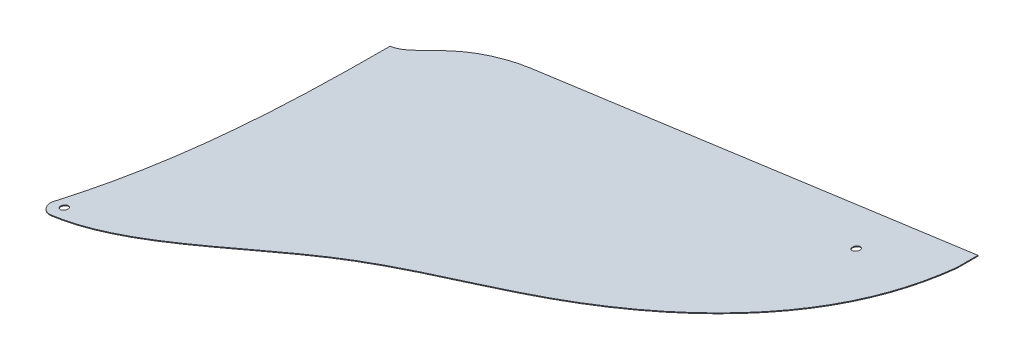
ISO-10303-21;
HEADER;
FILE_DESCRIPTION(('STEP AP214'),'2;1');
FILE_NAME('part.step','',(''),(''),'','','');
FILE_SCHEMA(('AUTOMOTIVE_DESIGN { 1 0 10303 214 1 1 1 1 }'));
ENDSEC;
DATA;
#1=APPLICATION_CONTEXT('core data for automotive mechanical design processes');
#2=APPLICATION_PROTOCOL_DEFINITION('international standard','automotive_design',2000,#1);
#3=PRODUCT_CONTEXT('',#1,'mechanical');
#4=PRODUCT('Part','Part','',(#3));
#5=PRODUCT_RELATED_PRODUCT_CATEGORY('part','',(#4));
#6=PRODUCT_DEFINITION_FORMATION('','',#4);
#7=PRODUCT_DEFINITION_CONTEXT('part definition',#1,'design');
#8=PRODUCT_DEFINITION('design','',#6,#7);
#9=PRODUCT_DEFINITION_SHAPE('','',#8);
#10=(LENGTH_UNIT() NAMED_UNIT(*) SI_UNIT(.MILLI.,.METRE.));
#11=(NAMED_UNIT(*) PLANE_ANGLE_UNIT() SI_UNIT($,.RADIAN.));
#12=(NAMED_UNIT(*) SI_UNIT($,.STERADIAN.) SOLID_ANGLE_UNIT());
#13=UNCERTAINTY_MEASURE_WITH_UNIT(LENGTH_MEASURE(1.E-05),#10,'distance_accuracy_value','');
#14=(GEOMETRIC_REPRESENTATION_CONTEXT(3) GLOBAL_UNCERTAINTY_ASSIGNED_CONTEXT((#13)) GLOBAL_UNIT_ASSIGNED_CONTEXT((#10,
#11,#12)) REPRESENTATION_CONTEXT('',''));
#15=CARTESIAN_POINT('',(0.,0.,0.));
#16=DIRECTION('',(0.,0.,1.));
#17=DIRECTION('',(1.,0.,0.));
#18=AXIS2_PLACEMENT_3D('',#15,#16,#17);
#19=CARTESIAN_POINT('',(2.243588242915,-0.1224751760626,-17.129));
#20=DIRECTION('',(0.136363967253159,-0.990658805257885,0.));
#21=DIRECTION('',(0.990658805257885,0.136363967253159,0.));
#22=AXIS2_PLACEMENT_3D('',#19,#20,#21);
#23=PLANE('',#22);
#24=CARTESIAN_POINT('',(143.620506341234,19.3380265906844,-3.3));
#25=DIRECTION('',(-0.136363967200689,0.990658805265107,0.));
#26=DIRECTION('',(-0.990658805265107,-0.136363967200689,0.));
#27=AXIS2_PLACEMENT_3D('',#24,#25,#26);
#28=CIRCLE('',#27,0.999999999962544);
#29=CARTESIAN_POINT('',(142.629847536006,19.2016626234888,-3.3));
#30=VERTEX_POINT('',#29);
#31=EDGE_CURVE('E212',#30,#30,#28,.T.);
#32=ORIENTED_EDGE('',*,*,#31,.T.);
#33=EDGE_LOOP('',(#32));
#34=FACE_BOUND('',#33,.T.);
#35=CARTESIAN_POINT('',(8.89090882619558,0.792527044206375,75.2));
#36=DIRECTION('',(-0.136363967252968,0.990658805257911,0.));
#37=DIRECTION('',(-0.990658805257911,-0.136363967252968,0.));
#38=AXIS2_PLACEMENT_3D('',#35,#36,#37);
#39=CIRCLE('',#38,0.999999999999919);
#40=CARTESIAN_POINT('',(7.90025002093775,0.656163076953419,75.2));
#41=VERTEX_POINT('',#40);
#42=EDGE_CURVE('E87',#41,#41,#39,.T.);
#43=ORIENTED_EDGE('',*,*,#42,.T.);
#44=EDGE_LOOP('',(#43));
#45=FACE_BOUND('',#44,.T.);
#46=CARTESIAN_POINT('',(5.42360300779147,0.315253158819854,75.2));
#47=CARTESIAN_POINT('',(5.82346646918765,0.370294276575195,74.0910827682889));
#48=CARTESIAN_POINT('',(6.20973839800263,0.423464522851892,72.9771907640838));
#49=CARTESIAN_POINT('',(6.95545757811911,0.526112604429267,70.740491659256));
#50=CARTESIAN_POINT('',(7.31490914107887,0.575591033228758,69.6176860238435));
#51=CARTESIAN_POINT('',(8.00745829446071,0.670920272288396,67.3638891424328));
#52=CARTESIAN_POINT('',(8.34055712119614,0.716771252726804,66.2328982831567));
#53=CARTESIAN_POINT('',(8.98020497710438,0.804818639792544,63.9662637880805));
#54=CARTESIAN_POINT('',(9.2868164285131,0.847023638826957,62.8306380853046));
#55=CARTESIAN_POINT('',(9.87505405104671,0.927994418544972,60.5527722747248));
#56=CARTESIAN_POINT('',(10.1566793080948,0.966760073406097,59.4105319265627));
#57=CARTESIAN_POINT('',(10.6956799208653,1.04095338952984,57.1202449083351));
#58=CARTESIAN_POINT('',(10.9530551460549,1.07638103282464,55.9721982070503));
#59=CARTESIAN_POINT('',(11.5669687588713,1.16088610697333,53.0968555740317));
#60=CARTESIAN_POINT('',(11.9089059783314,1.20795369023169,51.366367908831));
#61=CARTESIAN_POINT('',(12.543218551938,1.29526667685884,47.8962246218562));
#62=CARTESIAN_POINT('',(12.8355940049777,1.33551209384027,46.1565690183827));
#63=CARTESIAN_POINT('',(13.3745429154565,1.40969829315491,42.6675794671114));
#64=CARTESIAN_POINT('',(13.6210518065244,1.44363018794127,40.9182353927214));
#65=CARTESIAN_POINT('',(14.0713490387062,1.50561350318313,37.4140290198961));
#66=CARTESIAN_POINT('',(14.2751382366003,1.53366504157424,35.6591668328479));
#67=CARTESIAN_POINT('',(14.6873267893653,1.59040270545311,31.7297281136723));
#68=CARTESIAN_POINT('',(14.8854160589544,1.61766964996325,29.5540514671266));
#69=CARTESIAN_POINT('',(15.2292268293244,1.66499512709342,25.1982499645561));
#70=CARTESIAN_POINT('',(15.3749408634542,1.68505263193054,23.0181245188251));
#71=CARTESIAN_POINT('',(15.6212704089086,1.71895983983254,18.6548571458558));
#72=CARTESIAN_POINT('',(15.7218762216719,1.73280820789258,16.4717146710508));
#73=CARTESIAN_POINT('',(15.8848989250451,1.75524824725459,12.1117091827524));
#74=CARTESIAN_POINT('',(15.947448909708,1.76385823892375,9.93485109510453));
#75=CARTESIAN_POINT('',(16.0419842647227,1.77687100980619,5.5810160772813));
#76=CARTESIAN_POINT('',(16.0739768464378,1.78127478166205,3.40403929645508));
#77=CARTESIAN_POINT('',(16.1143234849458,1.78682848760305,-0.948651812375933));
#78=CARTESIAN_POINT('',(16.1226937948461,1.78798065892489,-3.124365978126));
#79=CARTESIAN_POINT('',(16.1227181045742,1.78798400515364,-5.30000000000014));
#80=B_SPLINE_CURVE_WITH_KNOTS('',3,(#46,#47,#48,#49,#50,#51,#52,#53,#54,#55,#56,#57,#58,#59,#60,
#61,#62,#63,#64,#65,#66,#67,#68,#69,#70,#71,#72,#73,#74,#75,#76,#77,#78,#79),.UNSPECIFIED.,.F.,
.F.,(4,2,2,2,2,2,2,2,2,2,2,2,2,2,2,2,4),(0.,3.54016044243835,7.07975053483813,10.6191744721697,
14.150015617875,17.6809858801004,21.2119751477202,26.5048585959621,31.7977314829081,
37.0979996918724,42.3981615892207,48.9519272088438,55.5066267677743,62.0627349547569,
68.5957804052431,75.1272837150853,81.654291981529),.UNSPECIFIED.);
#81=CARTESIAN_POINT('',(5.42360300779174,0.315253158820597,75.2000000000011));
#82=VERTEX_POINT('',#81);
#83=CARTESIAN_POINT('',(16.1227181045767,1.78798400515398,-5.30000000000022));
#84=VERTEX_POINT('',#83);
#85=EDGE_CURVE('E149',#82,#84,#80,.T.);
#86=ORIENTED_EDGE('',*,*,#85,.T.);
#87=CARTESIAN_POINT('',(16.1227181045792,1.78798400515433,-5.30000000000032));
#88=CARTESIAN_POINT('',(16.2384534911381,1.80391495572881,-5.29999489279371));
#89=CARTESIAN_POINT('',(16.3542037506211,1.81984795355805,-5.30221710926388));
#90=CARTESIAN_POINT('',(16.5855512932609,1.85169289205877,-5.31144087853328));
#91=CARTESIAN_POINT('',(16.7011485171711,1.86760482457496,-5.31844392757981));
#92=CARTESIAN_POINT('',(16.9319672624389,1.89937697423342,-5.3375571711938));
#93=CARTESIAN_POINT('',(17.0471886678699,1.91523717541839,-5.34966881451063));
#94=CARTESIAN_POINT('',(17.2769442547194,1.94686298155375,-5.37925722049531));
#95=CARTESIAN_POINT('',(17.3914785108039,1.96262859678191,-5.39673338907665));
#96=CARTESIAN_POINT('',(17.6154618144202,1.99345984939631,-5.43649128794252));
#97=CARTESIAN_POINT('',(17.7249450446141,2.0085301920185,-5.45857651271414));
#98=CARTESIAN_POINT('',(17.9427681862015,2.03851349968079,-5.50794164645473));
#99=CARTESIAN_POINT('',(18.0511079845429,2.05342644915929,-5.5352220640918));
#100=CARTESIAN_POINT('',(18.2662812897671,2.08304500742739,-5.59487013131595));
#101=CARTESIAN_POINT('',(18.3731162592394,2.09775081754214,-5.62723240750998));
#102=CARTESIAN_POINT('',(18.5851970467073,2.12694369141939,-5.69685033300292));
#103=CARTESIAN_POINT('',(18.6904429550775,2.14143076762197,-5.73410570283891));
#104=CARTESIAN_POINT('',(18.9455592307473,2.17654746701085,-5.83072824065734));
#105=CARTESIAN_POINT('',(19.0945117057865,2.19705074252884,-5.89257240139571));
#106=CARTESIAN_POINT('',(19.3888474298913,2.23756599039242,-6.02437710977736));
#107=CARTESIAN_POINT('',(19.5342299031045,2.2575778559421,-6.09433940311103));
#108=CARTESIAN_POINT('',(19.8222650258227,2.29722582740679,-6.24088535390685));
#109=CARTESIAN_POINT('',(19.964906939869,2.31686045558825,-6.31749033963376));
#110=CARTESIAN_POINT('',(20.1769668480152,2.34605045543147,-6.43582836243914));
#111=CARTESIAN_POINT('',(20.2473367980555,2.35573686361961,-6.4758464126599));
#112=CARTESIAN_POINT('',(20.3875654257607,2.37503930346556,-6.55678612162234));
#113=CARTESIAN_POINT('',(20.4574241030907,2.38465533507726,-6.59770778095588));
#114=CARTESIAN_POINT('',(20.666508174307,2.4134357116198,-6.72179542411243));
#115=CARTESIAN_POINT('',(20.8050325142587,2.43250355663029,-6.80616636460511));
#116=CARTESIAN_POINT('',(21.0804353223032,2.4704126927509,-6.97757923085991));
#117=CARTESIAN_POINT('',(21.2173138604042,2.48925399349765,-7.06462104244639));
#118=CARTESIAN_POINT('',(21.4930656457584,2.52721116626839,-7.24306588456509));
#119=CARTESIAN_POINT('',(21.6319041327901,2.54632225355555,-7.33452353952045));
#120=CARTESIAN_POINT('',(21.9083976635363,2.58438152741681,-7.51924418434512));
#121=CARTESIAN_POINT('',(22.0460526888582,2.60332971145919,-7.61250720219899));
#122=CARTESIAN_POINT('',(22.4570339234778,2.65990118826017,-7.89391551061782));
#123=CARTESIAN_POINT('',(22.7289955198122,2.69733664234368,-8.08408639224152));
#124=CARTESIAN_POINT('',(23.2713572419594,2.7719926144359,-8.46670249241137));
#125=CARTESIAN_POINT('',(23.5417572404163,2.8092131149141,-8.65914789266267));
#126=CARTESIAN_POINT('',(24.1350997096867,2.89088657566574,-9.08048310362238));
#127=CARTESIAN_POINT('',(24.4581289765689,2.935351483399,-9.3092515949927));
#128=CARTESIAN_POINT('',(24.9456330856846,3.00245631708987,-9.64832852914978));
#129=CARTESIAN_POINT('',(25.1086849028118,3.02490036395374,-9.76071315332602));
#130=CARTESIAN_POINT('',(25.4361256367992,3.06997250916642,-9.98348496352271));
#131=CARTESIAN_POINT('',(25.6005145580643,3.09260060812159,-10.0938721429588));
#132=CARTESIAN_POINT('',(25.9309020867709,3.13807837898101,-10.3119389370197));
#133=CARTESIAN_POINT('',(26.0968995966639,3.16092789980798,-10.4196202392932));
#134=CARTESIAN_POINT('',(26.3474420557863,3.19541501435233,-10.5786572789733));
#135=CARTESIAN_POINT('',(26.4312136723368,3.20694615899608,-10.6312553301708));
#136=CARTESIAN_POINT('',(26.5993205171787,3.2300860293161,-10.7355253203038));
#137=CARTESIAN_POINT('',(26.6836557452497,3.24169475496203,-10.7871972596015));
#138=CARTESIAN_POINT('',(26.9373812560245,3.27662001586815,-10.9407133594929));
#139=CARTESIAN_POINT('',(27.1076177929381,3.30005303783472,-11.0411382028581));
#140=CARTESIAN_POINT('',(27.4502437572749,3.34721542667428,-11.23817038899));
#141=CARTESIAN_POINT('',(27.622633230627,3.37094479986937,-11.334777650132));
#142=CARTESIAN_POINT('',(28.1428088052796,3.44254685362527,-11.6187773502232));
#143=CARTESIAN_POINT('',(28.4937043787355,3.49084755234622,-11.8004095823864));
#144=CARTESIAN_POINT('',(29.1982475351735,3.58782776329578,-12.1459087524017));
#145=CARTESIAN_POINT('',(29.55179798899,3.63649390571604,-12.309978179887));
#146=CARTESIAN_POINT('',(30.2658303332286,3.734780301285,-12.6233889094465));
#147=CARTESIAN_POINT('',(30.626321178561,3.78440178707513,-12.7727094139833));
#148=CARTESIAN_POINT('',(31.3533166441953,3.88447255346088,-13.0567934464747));
#149=CARTESIAN_POINT('',(31.7198272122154,3.93492265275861,-13.1915414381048));
#150=CARTESIAN_POINT('',(32.4578923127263,4.03651715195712,-13.4468101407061));
#151=CARTESIAN_POINT('',(32.8294494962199,4.08766191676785,-13.5673230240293));
#152=CARTESIAN_POINT('',(33.576575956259,4.1905037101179,-13.7946414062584));
#153=CARTESIAN_POINT('',(33.9521444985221,4.24220063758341,-13.9014493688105));
#154=CARTESIAN_POINT('',(34.6486450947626,4.33807379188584,-14.0865175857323));
#155=CARTESIAN_POINT('',(34.9690935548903,4.38218345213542,-14.1666417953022));
#156=CARTESIAN_POINT('',(35.6118366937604,4.47065690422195,-14.3177377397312));
#157=CARTESIAN_POINT('',(35.9341297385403,4.51502047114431,-14.3887165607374));
#158=CARTESIAN_POINT('',(36.5803395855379,4.60397111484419,-14.5218277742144));
#159=CARTESIAN_POINT('',(36.904255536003,4.64855807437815,-14.583964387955));
#160=CARTESIAN_POINT('',(37.5535022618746,4.73792674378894,-14.6996450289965));
#161=CARTESIAN_POINT('',(37.8788326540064,4.78270840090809,-14.7531912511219));
#162=CARTESIAN_POINT('',(38.5307074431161,4.87243882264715,-14.8518960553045));
#163=CARTESIAN_POINT('',(38.8572517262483,4.91738757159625,-14.8970554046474));
#164=CARTESIAN_POINT('',(39.5162320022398,5.00809606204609,-14.9797564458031));
#165=CARTESIAN_POINT('',(39.848683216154,5.05385789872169,-15.0171744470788));
#166=CARTESIAN_POINT('',(40.5144555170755,5.14550130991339,-15.0836546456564));
#167=CARTESIAN_POINT('',(40.8477767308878,5.19138290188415,-15.1127155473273));
#168=CARTESIAN_POINT('',(41.5150969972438,5.28323939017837,-15.1625496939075));
#169=CARTESIAN_POINT('',(41.8490961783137,5.32921430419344,-15.1833211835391));
#170=CARTESIAN_POINT('',(42.5175834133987,5.42123142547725,-15.2165989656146));
#171=CARTESIAN_POINT('',(42.8520715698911,5.46727364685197,-15.2291031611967));
#172=CARTESIAN_POINT('',(43.5213505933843,5.55939975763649,-15.2457999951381));
#173=CARTESIAN_POINT('',(43.85614152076,5.60548365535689,-15.2499901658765));
#174=CARTESIAN_POINT('',(44.1909336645,5.65156772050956,-15.2500006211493));
#175=B_SPLINE_CURVE_WITH_KNOTS('',3,(#87,#88,#89,#90,#91,#92,#93,#94,#95,#96,#97,#98,#99,#100,
#101,#102,#103,#104,#105,#106,#107,#108,#109,#110,#111,#112,#113,#114,#115,#116,#117,#118,#119,
#120,#121,#122,#123,#124,#125,#126,#127,#128,#129,#130,#131,#132,#133,#134,#135,#136,#137,#138,
#139,#140,#141,#142,#143,#144,#145,#146,#147,#148,#149,#150,#151,#152,#153,#154,#155,#156,#157,
#158,#159,#160,#161,#162,#163,#164,#165,#166,#167,#168,#169,#170,#171,#172,#173,#174),
.UNSPECIFIED.,.F.,.F.,(4,2,2,2,2,2,2,2,2,2,2,2,2,2,2,2,2,2,2,2,2,2,2,2,2,2,2,2,2,2,2,2,2,2,2,2,
2,2,2,2,2,2,2,4),(0.,0.35048112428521,0.701071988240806,1.05176234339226,1.40241387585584,
1.74039246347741,2.07840416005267,2.41606083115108,2.75369822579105,3.24113172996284,
3.7286702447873,4.21783661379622,4.46242314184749,4.70700983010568,5.19690802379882,
5.6867853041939,6.18881595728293,6.69085439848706,7.69269517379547,8.69461653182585,
9.88955570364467,10.4874402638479,11.0853267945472,11.6828306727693,11.9815809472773,
12.2803311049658,12.8773790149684,13.4744396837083,14.6682001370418,15.8462365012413,
17.0259109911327,18.2068310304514,19.3883974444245,20.5697511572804,21.56935792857,
22.5681854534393,23.5665345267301,24.5646281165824,25.5626303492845,26.5755208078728,
27.5885682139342,28.601830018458,29.6153487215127,30.6291681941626),.UNSPECIFIED.);
#176=CARTESIAN_POINT('',(44.1909336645,5.65156772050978,-15.2500003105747));
#177=VERTEX_POINT('',#176);
#178=EDGE_CURVE('E148',#84,#177,#175,.T.);
#179=ORIENTED_EDGE('',*,*,#178,.T.);
#180=DIRECTION('',(0.990658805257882,0.136363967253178,0.));
#181=VECTOR('',#180,1.);
#182=CARTESIAN_POINT('',(104.307639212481,13.9266190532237,-15.25));
#183=LINE('',#182,#181);
#184=CARTESIAN_POINT('',(164.424341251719,22.2016699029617,-15.25));
#185=VERTEX_POINT('',#184);
#186=EDGE_CURVE('E90',#177,#185,#183,.T.);
#187=ORIENTED_EDGE('',*,*,#186,.T.);
#188=DIRECTION('',(0.,0.,1.));
#189=VECTOR('',#188,1.);
#190=CARTESIAN_POINT('',(164.424341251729,22.201669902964,-12.4249999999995));
#191=LINE('',#190,#189);
#192=CARTESIAN_POINT('',(164.424341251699,22.201669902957,-9.60000000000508));
#193=VERTEX_POINT('',#192);
#194=EDGE_CURVE('E85',#185,#193,#191,.T.);
#195=ORIENTED_EDGE('',*,*,#194,.T.);
#196=CARTESIAN_POINT('',(164.424341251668,22.2016699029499,-9.60000000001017));
#197=CARTESIAN_POINT('',(164.34025832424,22.1900959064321,-8.99661350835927));
#198=CARTESIAN_POINT('',(164.247165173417,22.1772816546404,-8.39448718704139));
#199=CARTESIAN_POINT('',(164.042453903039,22.1491031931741,-7.19308197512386));
#200=CARTESIAN_POINT('',(163.930824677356,22.1337374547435,-6.59380501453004));
#201=CARTESIAN_POINT('',(163.688598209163,22.1003950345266,-5.39896265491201));
#202=CARTESIAN_POINT('',(163.557994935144,22.0824175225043,-4.80339849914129));
#203=CARTESIAN_POINT('',(163.277476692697,22.0438042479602,-3.61683978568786));
#204=CARTESIAN_POINT('',(163.127559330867,22.0231681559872,-3.02584580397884));
#205=CARTESIAN_POINT('',(162.808154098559,21.9792020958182,-1.84926239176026));
#206=CARTESIAN_POINT('',(162.638666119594,21.955872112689,-1.26367299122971));
#207=CARTESIAN_POINT('',(162.281744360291,21.9067419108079,-0.104513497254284));
#208=CARTESIAN_POINT('',(162.094507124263,21.8809687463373,0.46911823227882));
#209=CARTESIAN_POINT('',(161.700651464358,21.8267546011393,1.60946740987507));
#210=CARTESIAN_POINT('',(161.494035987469,21.7983140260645,2.17618589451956));
#211=CARTESIAN_POINT('',(161.061476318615,21.7387722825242,3.30196512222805));
#212=CARTESIAN_POINT('',(160.83553487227,21.7076714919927,3.86102694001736));
#213=CARTESIAN_POINT('',(160.364476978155,21.6428304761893,4.97079461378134));
#214=CARTESIAN_POINT('',(160.119362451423,21.609090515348,5.52150130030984));
#215=CARTESIAN_POINT('',(159.610223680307,21.5390076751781,6.61389422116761));
#216=CARTESIAN_POINT('',(159.346200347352,21.5026649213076,7.15558088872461));
#217=CARTESIAN_POINT('',(158.730033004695,21.4178496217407,8.36598934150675));
#218=CARTESIAN_POINT('',(158.372563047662,21.3686439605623,9.03195668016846));
#219=CARTESIAN_POINT('',(157.629336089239,21.2663389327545,10.3477047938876));
#220=CARTESIAN_POINT('',(157.243575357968,21.2132390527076,10.9974834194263));
#221=CARTESIAN_POINT('',(156.444952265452,21.1033087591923,12.2799041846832));
#222=CARTESIAN_POINT('',(156.032087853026,21.0464780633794,12.9125450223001));
#223=CARTESIAN_POINT('',(155.180659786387,20.9292791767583,14.159855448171));
#224=CARTESIAN_POINT('',(154.742098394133,20.8689112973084,14.7745266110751));
#225=CARTESIAN_POINT('',(153.839380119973,20.7446523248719,15.9873693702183));
#226=CARTESIAN_POINT('',(153.375148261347,20.6807509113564,16.585484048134));
#227=CARTESIAN_POINT('',(152.424046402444,20.5498319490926,17.763011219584));
#228=CARTESIAN_POINT('',(151.93717753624,20.4828145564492,18.3424246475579));
#229=CARTESIAN_POINT('',(150.942355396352,20.3458775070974,19.4825780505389));
#230=CARTESIAN_POINT('',(150.434400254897,20.2759575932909,20.0433163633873));
#231=CARTESIAN_POINT('',(149.398992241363,20.1334339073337,21.1461643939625));
#232=CARTESIAN_POINT('',(148.871538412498,20.0608300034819,21.6882731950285));
#233=CARTESIAN_POINT('',(147.696651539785,19.8991070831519,22.8553245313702));
#234=CARTESIAN_POINT('',(147.045470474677,19.8094721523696,23.4764247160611));
#235=CARTESIAN_POINT('',(145.719871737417,19.627003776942,24.6930073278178));
#236=CARTESIAN_POINT('',(145.045450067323,19.5341697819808,25.288485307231));
#237=CARTESIAN_POINT('',(143.675424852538,19.3455861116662,26.4544693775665));
#238=CARTESIAN_POINT('',(142.979815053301,19.249835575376,27.0249679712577));
#239=CARTESIAN_POINT('',(141.56943775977,19.0556974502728,28.1415758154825));
#240=CARTESIAN_POINT('',(140.854666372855,18.9573093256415,28.6876800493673));
#241=CARTESIAN_POINT('',(139.407952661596,18.7581695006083,29.7560413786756));
#242=CARTESIAN_POINT('',(138.676011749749,18.657417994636,30.2783004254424));
#243=CARTESIAN_POINT('',(137.197117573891,18.453848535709,31.2993386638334));
#244=CARTESIAN_POINT('',(136.450176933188,18.3510323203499,31.7981365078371));
#245=CARTESIAN_POINT('',(134.94236127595,18.1434818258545,32.7733069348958));
#246=CARTESIAN_POINT('',(134.181490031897,18.0387480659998,33.2496854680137));
#247=CARTESIAN_POINT('',(132.646974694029,17.8275223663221,34.1808464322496));
#248=CARTESIAN_POINT('',(131.87333151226,17.721030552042,34.6356303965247));
#249=CARTESIAN_POINT('',(130.314376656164,17.5064407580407,35.5243382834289));
#250=CARTESIAN_POINT('',(129.529064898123,17.3983427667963,35.9582620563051));
#251=CARTESIAN_POINT('',(127.947838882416,17.1806873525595,36.8058970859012));
#252=CARTESIAN_POINT('',(127.151924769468,17.0711299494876,37.2196086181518));
#253=CARTESIAN_POINT('',(125.247695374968,16.8090131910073,38.1801507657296));
#254=CARTESIAN_POINT('',(124.135017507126,16.6558533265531,38.718186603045));
#255=CARTESIAN_POINT('',(121.893227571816,16.3472714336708,39.7586548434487));
#256=CARTESIAN_POINT('',(120.764112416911,16.1918489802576,40.2610804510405));
#257=CARTESIAN_POINT('',(118.491173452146,15.878979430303,41.23164528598));
#258=CARTESIAN_POINT('',(117.347345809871,15.7215318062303,41.69977535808));
#259=CARTESIAN_POINT('',(115.046634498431,15.4048393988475,42.6028266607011));
#260=CARTESIAN_POINT('',(113.889748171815,15.2455942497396,43.0377409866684));
#261=CARTESIAN_POINT('',(111.564477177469,14.9255212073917,43.875053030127));
#262=CARTESIAN_POINT('',(110.396092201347,14.7646932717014,44.2774498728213));
#263=CARTESIAN_POINT('',(108.050722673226,14.4418536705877,45.0539616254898));
#264=CARTESIAN_POINT('',(106.873741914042,14.2798425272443,45.4280882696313));
#265=CARTESIAN_POINT('',(104.510319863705,13.9545180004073,46.1540185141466));
#266=CARTESIAN_POINT('',(103.323863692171,13.7912025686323,46.5057724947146));
#267=CARTESIAN_POINT('',(100.946401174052,13.4639453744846,47.1912749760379));
#268=CARTESIAN_POINT('',(99.755396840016,13.3000038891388,47.5250306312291));
#269=CARTESIAN_POINT('',(97.3701130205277,12.9716700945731,48.1802819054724));
#270=CARTESIAN_POINT('',(96.1758335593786,12.8072777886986,48.5017776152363));
#271=CARTESIAN_POINT('',(93.785304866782,12.4782220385,49.1383717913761));
#272=CARTESIAN_POINT('',(92.5890552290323,12.3135585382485,49.4534686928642));
#273=CARTESIAN_POINT('',(90.1959198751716,11.9841439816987,50.0832358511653));
#274=CARTESIAN_POINT('',(88.9990341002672,11.8193929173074,50.3979058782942));
#275=CARTESIAN_POINT('',(86.6059823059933,11.4899898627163,51.0328814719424));
#276=CARTESIAN_POINT('',(85.4098170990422,11.3253379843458,51.3531901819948));
#277=CARTESIAN_POINT('',(83.1381854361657,11.0126483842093,51.973206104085));
#278=CARTESIAN_POINT('',(82.0624319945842,10.8645711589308,52.271836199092));
#279=CARTESIAN_POINT('',(79.9146377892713,10.5689277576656,52.8828862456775));
#280=CARTESIAN_POINT('',(78.8425974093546,10.4213616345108,53.1953075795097));
#281=CARTESIAN_POINT('',(76.7042637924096,10.1270204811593,53.8381179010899));
#282=CARTESIAN_POINT('',(75.6379684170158,9.98024515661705,54.168499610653));
#283=CARTESIAN_POINT('',(73.5131043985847,9.68775809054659,54.8513133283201));
#284=CARTESIAN_POINT('',(72.4545308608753,9.54204567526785,55.2037297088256));
#285=CARTESIAN_POINT('',(70.8737658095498,9.32445371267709,55.7518776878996));
#286=CARTESIAN_POINT('',(70.3482188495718,9.25211228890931,55.9377755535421));
#287=CARTESIAN_POINT('',(69.2996064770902,9.10777102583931,56.31658333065));
#288=CARTESIAN_POINT('',(68.7765410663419,9.0357711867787,56.5094932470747));
#289=CARTESIAN_POINT('',(67.7334431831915,8.8921889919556,56.9026728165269));
#290=CARTESIAN_POINT('',(67.2134092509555,8.82060643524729,57.1029385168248));
#291=CARTESIAN_POINT('',(66.4356419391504,8.7135469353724,57.4092321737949));
#292=CARTESIAN_POINT('',(66.1767667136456,8.67791281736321,57.5123125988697));
#293=CARTESIAN_POINT('',(65.6598193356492,8.60675512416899,57.7205052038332));
#294=CARTESIAN_POINT('',(65.401747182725,8.57123154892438,57.8256173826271));
#295=CARTESIAN_POINT('',(64.6264665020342,8.46451433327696,58.1448681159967));
#296=CARTESIAN_POINT('',(64.1104744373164,8.39348813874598,58.3620225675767));
#297=CARTESIAN_POINT('',(63.0814894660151,8.25184858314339,58.8034509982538));
#298=CARTESIAN_POINT('',(62.5684965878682,8.18123522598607,59.0277250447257));
#299=CARTESIAN_POINT('',(61.5449860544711,8.04034922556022,59.482696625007));
#300=CARTESIAN_POINT('',(61.0344698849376,7.97007678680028,59.7133975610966));
#301=CARTESIAN_POINT('',(60.0159186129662,7.82987342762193,60.1803008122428));
#302=CARTESIAN_POINT('',(59.5078835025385,7.75994250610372,60.4165031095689));
#303=CARTESIAN_POINT('',(57.9862959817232,7.55049631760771,61.1325520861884));
#304=CARTESIAN_POINT('',(56.9760233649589,7.41143251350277,61.6194994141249));
#305=CARTESIAN_POINT('',(54.9610995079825,7.13407868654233,62.6066506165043));
#306=CARTESIAN_POINT('',(53.9564522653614,6.99578921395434,63.106862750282));
#307=CARTESIAN_POINT('',(51.9504542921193,6.71966403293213,64.1147129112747));
#308=CARTESIAN_POINT('',(50.9491046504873,6.58182847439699,64.6223531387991));
#309=CARTESIAN_POINT('',(48.9474299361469,6.30629838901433,65.6392997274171));
#310=CARTESIAN_POINT('',(47.9471047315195,6.16860384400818,66.1486058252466));
#311=CARTESIAN_POINT('',(46.0693808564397,5.91013556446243,67.1002279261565));
#312=CARTESIAN_POINT('',(45.1922006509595,5.78939190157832,67.5429815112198));
#313=CARTESIAN_POINT('',(43.4349792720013,5.54751076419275,68.4217019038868));
#314=CARTESIAN_POINT('',(42.5549395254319,5.42637348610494,68.8576716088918));
#315=CARTESIAN_POINT('',(40.7900601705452,5.18343823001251,69.7191013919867));
#316=CARTESIAN_POINT('',(39.9052217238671,5.06164041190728,70.1445638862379));
#317=CARTESIAN_POINT('',(38.1287602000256,4.81711087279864,70.9811597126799));
#318=CARTESIAN_POINT('',(37.2371362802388,4.69437903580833,71.3922912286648));
#319=CARTESIAN_POINT('',(35.44505126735,4.44769892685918,72.1962658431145));
#320=CARTESIAN_POINT('',(34.5445844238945,4.32374986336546,72.5890959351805));
#321=CARTESIAN_POINT('',(32.7450904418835,4.07604991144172,73.3470902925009));
#322=CARTESIAN_POINT('',(31.8461788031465,3.95231492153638,73.7125327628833));
#323=CARTESIAN_POINT('',(30.0377315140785,3.70338254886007,74.4165233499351));
#324=CARTESIAN_POINT('',(29.1281928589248,3.57818475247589,74.7550636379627));
#325=CARTESIAN_POINT('',(27.2985206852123,3.32633077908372,75.4002162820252));
#326=CARTESIAN_POINT('',(26.3783926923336,3.19967536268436,75.7068445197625));
#327=CARTESIAN_POINT('',(24.5276152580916,2.94491625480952,76.2832141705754));
#328=CARTESIAN_POINT('',(23.5969747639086,2.81681379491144,76.5529847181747));
#329=CARTESIAN_POINT('',(21.7252351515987,2.55916924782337,77.0508242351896));
#330=CARTESIAN_POINT('',(20.7841418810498,2.42962796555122,77.27891538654));
#331=CARTESIAN_POINT('',(19.24323471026,2.21752243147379,77.6126532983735));
#332=CARTESIAN_POINT('',(18.6463810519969,2.13536565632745,77.7323267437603));
#333=CARTESIAN_POINT('',(17.4491488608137,1.97056690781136,77.9521919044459));
#334=CARTESIAN_POINT('',(16.8487703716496,1.88792494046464,78.0523838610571));
#335=CARTESIAN_POINT('',(15.6450565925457,1.72223400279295,78.2322067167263));
#336=CARTESIAN_POINT('',(15.0417216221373,1.6391850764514,78.3118397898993));
#337=CARTESIAN_POINT('',(13.8236622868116,1.47151947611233,78.4506259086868));
#338=CARTESIAN_POINT('',(13.2089017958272,1.38689782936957,78.5094574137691));
#339=CARTESIAN_POINT('',(11.9775427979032,1.21740153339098,78.6041087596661));
#340=CARTESIAN_POINT('',(11.3609440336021,1.13252684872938,78.6399252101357));
#341=CARTESIAN_POINT('',(10.1265417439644,0.962611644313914,78.6878940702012));
#342=CARTESIAN_POINT('',(9.50873777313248,0.8775710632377,78.7000347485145));
#343=CARTESIAN_POINT('',(8.89090882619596,0.79252704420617,78.7000000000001));
#344=B_SPLINE_CURVE_WITH_KNOTS('',3,(#196,#197,#198,#199,#200,#201,#202,#203,#204,#205,#206,
#207,#208,#209,#210,#211,#212,#213,#214,#215,#216,#217,#218,#219,#220,#221,#222,#223,#224,#225,
#226,#227,#228,#229,#230,#231,#232,#233,#234,#235,#236,#237,#238,#239,#240,#241,#242,#243,#244,
#245,#246,#247,#248,#249,#250,#251,#252,#253,#254,#255,#256,#257,#258,#259,#260,#261,#262,#263,
#264,#265,#266,#267,#268,#269,#270,#271,#272,#273,#274,#275,#276,#277,#278,#279,#280,#281,#282,
#283,#284,#285,#286,#287,#288,#289,#290,#291,#292,#293,#294,#295,#296,#297,#298,#299,#300,#301,
#302,#303,#304,#305,#306,#307,#308,#309,#310,#311,#312,#313,#314,#315,#316,#317,#318,#319,#320,
#321,#322,#323,#324,#325,#326,#327,#328,#329,#330,#331,#332,#333,#334,#335,#336,#337,#338,#339,
#340,#341,#342,#343),.UNSPECIFIED.,.F.,.F.,(4,2,2,2,2,2,2,2,2,2,2,2,2,2,2,2,2,2,2,2,2,2,2,2,2,2,
2,2,2,2,2,2,2,2,2,2,2,2,2,2,2,2,2,2,2,2,2,2,2,2,2,2,2,2,2,2,2,2,2,2,2,2,2,2,2,2,2,2,2,2,2,2,2,
4),(0.,1.82793951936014,3.65697825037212,5.48659967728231,7.31644804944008,9.14630656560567,
10.957854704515,12.7691277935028,14.5801439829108,16.3909789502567,18.2017266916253,
20.4733061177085,22.7451855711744,25.017237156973,27.2890890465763,29.5679683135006,
31.8467335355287,34.1257010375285,36.4047805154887,39.117081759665,41.8298519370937,
44.5434308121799,47.2575651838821,49.9714770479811,52.6831934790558,55.3941861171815,
58.1049859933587,60.8158053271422,63.5265876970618,67.2620613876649,70.9982460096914,
74.7354244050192,78.4733775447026,82.2114312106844,85.9479246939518,89.692435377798,
93.4354464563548,97.1784298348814,100.922317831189,104.667750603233,108.415342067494,
111.793914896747,115.172827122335,118.550380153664,121.925564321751,123.611915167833,
125.298267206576,126.98372595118,127.826455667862,128.669184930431,130.362056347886,
132.054943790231,133.748745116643,135.442540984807,138.832656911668,142.224935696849,
145.618240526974,149.011032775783,151.980951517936,154.949564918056,157.917489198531,
160.885788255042,163.856165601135,166.790443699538,169.72557258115,172.659233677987,
175.590562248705,178.520326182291,180.362804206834,182.205259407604,184.047519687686,
185.917125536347,187.78700673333,189.657814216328),.UNSPECIFIED.);
#345=CARTESIAN_POINT('',(8.89090882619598,0.792527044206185,78.7));
#346=VERTEX_POINT('',#345);
#347=EDGE_CURVE('E21',#193,#346,#344,.T.);
#348=ORIENTED_EDGE('',*,*,#347,.T.);
#349=CARTESIAN_POINT('',(8.89090882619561,0.792527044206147,75.2));
#350=DIRECTION('',(-0.136363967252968,0.990658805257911,0.));
#351=DIRECTION('',(-0.990658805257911,-0.136363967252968,0.));
#352=AXIS2_PLACEMENT_3D('',#349,#350,#351);
#353=CIRCLE('',#352,3.50000000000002);
#354=EDGE_CURVE('E159',#346,#82,#353,.F.);
#355=ORIENTED_EDGE('',*,*,#354,.T.);
#356=EDGE_LOOP('',(#86,#179,#187,#195,#348,#355));
#357=FACE_BOUND('',#356,.T.);
#358=ADVANCED_FACE('F16',(#34,#45,#357),#23,.T.);
#359=CARTESIAN_POINT('',(7.012391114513,0.5299117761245,78.66247188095));
#360=CARTESIAN_POINT('',(7.641631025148,0.6165265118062,78.6876692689));
#361=CARTESIAN_POINT('',(28.86399726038,3.537780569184,79.1054902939));
#362=CARTESIAN_POINT('',(61.08046818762,7.972370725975,54.51567693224));
#363=CARTESIAN_POINT('',(113.4567140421,15.18194947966,46.67202631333));
#364=CARTESIAN_POINT('',(153.1666325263,20.64801104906,23.49322009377));
#365=CARTESIAN_POINT('',(163.3322462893,22.04730555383,-0.682376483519));
#366=CARTESIAN_POINT('',(164.5916773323,22.22066596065,-10.86872133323));
#367=CARTESIAN_POINT('',(164.6612593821,22.23024391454,-11.51289203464));
#368=B_SPLINE_CURVE_WITH_KNOTS('',3,(#359,#360,#361,#362,#363,#364,#365,#366,#367),
.UNSPECIFIED.,.F.,.F.,(4,1,1,1,1,1,4),(0.,0.009666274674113,0.3275371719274,0.5861839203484,
0.8538980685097,0.9908550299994,1.),.UNSPECIFIED.);
#369=DIRECTION('',(-0.136363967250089,0.990658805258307,0.));
#370=VECTOR('',#369,1.);
#371=SURFACE_OF_LINEAR_EXTRUSION('',#368,#370);
#372=ORIENTED_EDGE('',*,*,#347,.F.);
#373=DIRECTION('',(-0.13636396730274,0.99065880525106,0.));
#374=VECTOR('',#373,1.);
#375=CARTESIAN_POINT('',(164.410704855,22.30073578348,-9.6));
#376=LINE('',#375,#374);
#377=CARTESIAN_POINT('',(164.397068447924,22.3998016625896,-9.59999992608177));
#378=VERTEX_POINT('',#377);
#379=EDGE_CURVE('E79',#193,#378,#376,.T.);
#380=ORIENTED_EDGE('',*,*,#379,.T.);
#381=CARTESIAN_POINT('',(164.397068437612,22.3998016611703,-9.59999985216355));
#382=CARTESIAN_POINT('',(164.312985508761,22.3882276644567,-8.99661336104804));
#383=CARTESIAN_POINT('',(164.219892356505,22.3754134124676,-8.39448704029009));
#384=CARTESIAN_POINT('',(164.015181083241,22.347234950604,-7.19308182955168));
#385=CARTESIAN_POINT('',(163.903551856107,22.3318692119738,-6.59380486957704));
#386=CARTESIAN_POINT('',(163.661325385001,22.2985267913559,-5.39896251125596));
#387=CARTESIAN_POINT('',(163.530722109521,22.2805492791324,-4.80339835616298));
#388=CARTESIAN_POINT('',(163.250203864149,22.2419360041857,-3.61683964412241));
#389=CARTESIAN_POINT('',(163.100286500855,22.221299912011,-3.0258456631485));
#390=CARTESIAN_POINT('',(162.780881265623,22.1773338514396,-1.849262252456));
#391=CARTESIAN_POINT('',(162.611393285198,22.1540038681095,-1.26367285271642));
#392=CARTESIAN_POINT('',(162.254471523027,22.1048736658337,-0.104513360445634));
#393=CARTESIAN_POINT('',(162.067234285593,22.0791005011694,0.469118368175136));
#394=CARTESIAN_POINT('',(161.673378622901,22.024886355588,1.60946754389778));
#395=CARTESIAN_POINT('',(161.466763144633,21.9964457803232,2.176186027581));
#396=CARTESIAN_POINT('',(161.034203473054,21.9369040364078,3.30196525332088));
#397=CARTESIAN_POINT('',(160.808262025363,21.905803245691,3.86102707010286));
#398=CARTESIAN_POINT('',(160.3372041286,21.8409622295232,4.97079474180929));
#399=CARTESIAN_POINT('',(160.092089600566,21.8072222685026,5.52150142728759));
#400=CARTESIAN_POINT('',(159.582950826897,21.7371394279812,6.61389434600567));
#401=CARTESIAN_POINT('',(159.318927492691,21.7007966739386,7.15558101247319));
#402=CARTESIAN_POINT('',(158.702760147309,21.6159813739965,8.36598946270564));
#403=CARTESIAN_POINT('',(158.34529018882,21.5667757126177,9.03195679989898));
#404=CARTESIAN_POINT('',(157.602063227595,21.4644706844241,10.3477049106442));
#405=CARTESIAN_POINT('',(157.216302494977,21.4113708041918,10.9974835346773));
#406=CARTESIAN_POINT('',(156.417679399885,21.3014405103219,12.2799042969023));
#407=CARTESIAN_POINT('',(156.00481498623,21.2446098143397,12.9125451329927));
#408=CARTESIAN_POINT('',(155.153386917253,21.1274109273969,14.1598555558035));
#409=CARTESIAN_POINT('',(154.714825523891,21.0670430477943,14.7745267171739));
#410=CARTESIAN_POINT('',(153.812107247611,20.9427840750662,15.9873694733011));
#411=CARTESIAN_POINT('',(153.347875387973,20.8788826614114,16.5854841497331));
#412=CARTESIAN_POINT('',(152.396773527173,20.7479636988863,17.7630113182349));
#413=CARTESIAN_POINT('',(151.909904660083,20.680946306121,18.3424247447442));
#414=CARTESIAN_POINT('',(150.915082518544,20.5440092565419,19.482578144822));
#415=CARTESIAN_POINT('',(150.407127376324,20.4740893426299,20.0433164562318));
#416=CARTESIAN_POINT('',(149.371719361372,20.3315656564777,21.146164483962));
#417=CARTESIAN_POINT('',(148.844265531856,20.2589617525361,21.6882732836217));
#418=CARTESIAN_POINT('',(147.669378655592,20.0972388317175,22.8553246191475));
#419=CARTESIAN_POINT('',(147.018197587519,20.0076039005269,23.4764248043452));
#420=CARTESIAN_POINT('',(145.692598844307,19.8251355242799,24.6930074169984));
#421=CARTESIAN_POINT('',(145.018177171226,19.7323015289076,25.2884853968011));
#422=CARTESIAN_POINT('',(143.648151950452,19.5437178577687,26.4544694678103));
#423=CARTESIAN_POINT('',(142.952542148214,19.4479673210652,27.0249680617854));
#424=CARTESIAN_POINT('',(141.542164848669,19.2538291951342,28.1415759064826));
#425=CARTESIAN_POINT('',(140.827393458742,19.1554410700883,28.6876801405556));
#426=CARTESIAN_POINT('',(139.380679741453,18.9563012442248,29.7560414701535));
#427=CARTESIAN_POINT('',(138.648738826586,18.855549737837,30.2783005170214));
#428=CARTESIAN_POINT('',(137.169844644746,18.6519802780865,31.2993387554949));
#429=CARTESIAN_POINT('',(136.42290400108,18.5491640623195,31.7981365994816));
#430=CARTESIAN_POINT('',(134.915088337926,18.3416135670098,32.7733070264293));
#431=CARTESIAN_POINT('',(134.15421709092,18.2368798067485,33.2496855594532));
#432=CARTESIAN_POINT('',(132.619701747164,18.0256541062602,34.1808465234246));
#433=CARTESIAN_POINT('',(131.846058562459,17.919162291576,34.6356304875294));
#434=CARTESIAN_POINT('',(130.287103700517,17.70457249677,35.5243383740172));
#435=CARTESIAN_POINT('',(129.501791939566,17.5964745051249,35.9582621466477));
#436=CARTESIAN_POINT('',(127.920565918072,17.3788190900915,36.8058971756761));
#437=CARTESIAN_POINT('',(127.124651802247,17.2692616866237,37.2196087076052));
#438=CARTESIAN_POINT('',(125.220422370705,17.0071449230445,38.1801508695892));
#439=CARTESIAN_POINT('',(124.107744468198,16.8539850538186,38.7181867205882));
#440=CARTESIAN_POINT('',(121.86595446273,16.5454031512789,39.7586549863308));
#441=CARTESIAN_POINT('',(120.736839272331,16.38998069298,40.2610806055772));
#442=CARTESIAN_POINT('',(118.463900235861,16.0771111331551,41.2316454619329));
#443=CARTESIAN_POINT('',(117.320072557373,15.9196635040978,41.6997755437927));
#444=CARTESIAN_POINT('',(115.019361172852,15.6029710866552,42.6028268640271));
#445=CARTESIAN_POINT('',(113.862474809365,15.4437259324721,43.0377411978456));
#446=CARTESIAN_POINT('',(111.537203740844,15.1236528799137,43.8750532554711));
#447=CARTESIAN_POINT('',(110.368818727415,14.9628249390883,44.2774501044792));
#448=CARTESIAN_POINT('',(108.023449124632,14.6399853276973,45.0539618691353));
#449=CARTESIAN_POINT('',(106.846468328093,14.4779741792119,45.4280885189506));
#450=CARTESIAN_POINT('',(104.483046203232,14.1526496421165,46.1540187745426));
#451=CARTESIAN_POINT('',(103.29658999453,13.9893342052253,46.5057727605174));
#452=CARTESIAN_POINT('',(100.919127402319,13.6620770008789,47.1912752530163));
#453=CARTESIAN_POINT('',(99.7281230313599,13.4981355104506,47.5250309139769));
#454=CARTESIAN_POINT('',(97.3428391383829,13.1698017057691,48.1802822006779));
#455=CARTESIAN_POINT('',(96.1485596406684,13.0054093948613,48.5017779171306));
#456=CARTESIAN_POINT('',(93.7580308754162,12.6763536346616,49.1383721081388));
#457=CARTESIAN_POINT('',(92.5617812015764,12.5116901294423,49.4534690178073));
#458=CARTESIAN_POINT('',(90.1686457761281,12.1822755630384,50.0832361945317));
#459=CARTESIAN_POINT('',(88.9717599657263,12.0175244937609,50.3979062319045));
#460=CARTESIAN_POINT('',(86.5787081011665,11.6881214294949,51.0328818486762));
#461=CARTESIAN_POINT('',(85.3825428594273,11.5234695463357,51.3531905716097));
#462=CARTESIAN_POINT('',(83.1109111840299,11.2107799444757,51.973206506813));
#463=CARTESIAN_POINT('',(82.0351577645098,11.0627027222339,52.2718366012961));
#464=CARTESIAN_POINT('',(79.88736360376,10.7670593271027,52.8828866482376));
#465=CARTESIAN_POINT('',(78.8153232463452,10.6194932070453,53.1953079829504));
#466=CARTESIAN_POINT('',(76.676989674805,10.3251520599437,53.8381183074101));
#467=CARTESIAN_POINT('',(75.6106943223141,10.178376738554,54.1685000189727));
#468=CARTESIAN_POINT('',(73.4858303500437,9.88588967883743,54.8513137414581));
#469=CARTESIAN_POINT('',(72.4272568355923,9.74017726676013,55.2037301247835));
#470=CARTESIAN_POINT('',(70.8464918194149,9.52258530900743,55.7518781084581));
#471=CARTESIAN_POINT('',(70.3209448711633,9.45024388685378,55.9377759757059));
#472=CARTESIAN_POINT('',(69.2723325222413,9.30590262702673,56.3165837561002));
#473=CARTESIAN_POINT('',(68.7492671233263,9.23390278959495,56.5094936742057));
#474=CARTESIAN_POINT('',(67.7061692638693,9.0903205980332,56.9026732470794));
#475=CARTESIAN_POINT('',(67.1861353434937,9.01873804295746,57.1029389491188));
#476=CARTESIAN_POINT('',(66.4083680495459,8.91167854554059,57.4092326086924));
#477=CARTESIAN_POINT('',(66.149492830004,8.8760444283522,57.5123130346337));
#478=CARTESIAN_POINT('',(65.6325454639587,8.80488673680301,57.7205056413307));
#479=CARTESIAN_POINT('',(65.3744733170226,8.76936316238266,57.8256178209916));
#480=CARTESIAN_POINT('',(64.5991926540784,8.66264594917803,58.1448685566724));
#481=CARTESIAN_POINT('',(64.0832006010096,8.59161975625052,58.3620230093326));
#482=CARTESIAN_POINT('',(63.0542156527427,8.44998020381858,58.8034514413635));
#483=CARTESIAN_POINT('',(62.5412227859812,8.37936684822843,59.0277254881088));
#484=CARTESIAN_POINT('',(61.517712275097,8.23848085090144,59.4826970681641));
#485=CARTESIAN_POINT('',(61.0071961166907,8.16820841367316,59.7133980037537));
#486=CARTESIAN_POINT('',(59.9886448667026,8.02800505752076,60.1803012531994));
#487=CARTESIAN_POINT('',(59.4806097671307,7.95807413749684,60.4165035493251));
#488=CARTESIAN_POINT('',(57.95902227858,7.74862795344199,61.1325525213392));
#489=CARTESIAN_POINT('',(56.948749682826,7.60956415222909,61.6194998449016));
#490=CARTESIAN_POINT('',(54.9338258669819,7.33221033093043,62.606651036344));
#491=CARTESIAN_POINT('',(53.9291786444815,7.19392086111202,63.1068631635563));
#492=CARTESIAN_POINT('',(51.9231807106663,6.91779568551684,64.1147133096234));
#493=CARTESIAN_POINT('',(50.9218310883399,6.77996012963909,64.6223535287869));
#494=CARTESIAN_POINT('',(48.920156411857,6.50443004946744,65.6393000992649));
#495=CARTESIAN_POINT('',(47.9198312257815,6.36673550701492,66.1486061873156));
#496=CARTESIAN_POINT('',(46.0421073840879,6.10826723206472,67.100228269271));
#497=CARTESIAN_POINT('',(45.164927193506,5.98752357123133,67.5429818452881));
#498=CARTESIAN_POINT('',(43.4077058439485,5.7456424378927,68.4217022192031));
#499=CARTESIAN_POINT('',(42.5276661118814,5.6245051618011,68.8576719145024));
#500=CARTESIAN_POINT('',(40.762786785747,5.38156990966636,69.7191016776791));
#501=CARTESIAN_POINT('',(39.8779483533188,5.25977209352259,70.1445641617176));
#502=CARTESIAN_POINT('',(38.1014868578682,5.0152425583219,70.9811599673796));
#503=CARTESIAN_POINT('',(37.2098629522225,4.89251072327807,71.392291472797));
#504=CARTESIAN_POINT('',(35.4177779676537,4.64583061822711,72.1962660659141));
#505=CARTESIAN_POINT('',(34.5173111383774,4.52188155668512,72.5890961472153));
#506=CARTESIAN_POINT('',(32.7178171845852,4.27418160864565,73.3470904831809));
#507=CARTESIAN_POINT('',(31.8189055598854,4.1504466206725,73.7125329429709));
#508=CARTESIAN_POINT('',(30.0104582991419,3.90151425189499,74.4165235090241));
#509=CARTESIAN_POINT('',(29.1009196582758,3.77631645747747,74.7550637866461));
#510=CARTESIAN_POINT('',(27.2712475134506,3.52446248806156,75.4002164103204));
#511=CARTESIAN_POINT('',(26.3511195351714,3.3978070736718,75.7068446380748));
#512=CARTESIAN_POINT('',(24.500342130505,3.14304796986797,76.2832142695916));
#513=CARTESIAN_POINT('',(23.5697016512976,3.01494551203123,76.5529848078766));
#514=CARTESIAN_POINT('',(21.6979620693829,2.75730096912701,77.0508243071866));
#515=CARTESIAN_POINT('',(20.7568688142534,2.62775968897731,77.2789154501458));
#516=CARTESIAN_POINT('',(19.2159616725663,2.4156541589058,77.6126533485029));
#517=CARTESIAN_POINT('',(18.6191080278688,2.33349738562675,77.7323267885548));
#518=CARTESIAN_POINT('',(17.4218758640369,2.16869864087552,77.9521919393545));
#519=CARTESIAN_POINT('',(16.8214973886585,2.08605667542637,78.0523838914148));
#520=CARTESIAN_POINT('',(15.6177836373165,1.92036574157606,78.2322067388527));
#521=CARTESIAN_POINT('',(15.0144486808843,1.83731681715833,78.3118398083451));
#522=CARTESIAN_POINT('',(13.7963893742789,1.66965122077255,78.4506259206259));
#523=CARTESIAN_POINT('',(13.1816288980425,1.58502957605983,78.5094574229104));
#524=CARTESIAN_POINT('',(11.9502699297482,1.41553328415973,78.6041087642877));
#525=CARTESIAN_POINT('',(11.3336711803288,1.33065860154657,78.639925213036));
#526=CARTESIAN_POINT('',(10.0992689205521,1.16074340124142,78.6878940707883));
#527=CARTESIAN_POINT('',(9.48146496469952,1.07570282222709,78.7000347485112));
#528=CARTESIAN_POINT('',(8.86363603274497,0.990658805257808,78.7000000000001));
#529=B_SPLINE_CURVE_WITH_KNOTS('',3,(#381,#382,#383,#384,#385,#386,#387,#388,#389,#390,#391,
#392,#393,#394,#395,#396,#397,#398,#399,#400,#401,#402,#403,#404,#405,#406,#407,#408,#409,#410,
#411,#412,#413,#414,#415,#416,#417,#418,#419,#420,#421,#422,#423,#424,#425,#426,#427,#428,#429,
#430,#431,#432,#433,#434,#435,#436,#437,#438,#439,#440,#441,#442,#443,#444,#445,#446,#447,#448,
#449,#450,#451,#452,#453,#454,#455,#456,#457,#458,#459,#460,#461,#462,#463,#464,#465,#466,#467,
#468,#469,#470,#471,#472,#473,#474,#475,#476,#477,#478,#479,#480,#481,#482,#483,#484,#485,#486,
#487,#488,#489,#490,#491,#492,#493,#494,#495,#496,#497,#498,#499,#500,#501,#502,#503,#504,#505,
#506,#507,#508,#509,#510,#511,#512,#513,#514,#515,#516,#517,#518,#519,#520,#521,#522,#523,#524,
#525,#526,#527,#528),.UNSPECIFIED.,.F.,.F.,(4,2,2,2,2,2,2,2,2,2,2,2,2,2,2,2,2,2,2,2,2,2,2,2,2,2,
2,2,2,2,2,2,2,2,2,2,2,2,2,2,2,2,2,2,2,2,2,2,2,2,2,2,2,2,2,2,2,2,2,2,2,2,2,2,2,2,2,2,2,2,2,2,2,
4),(0.,1.8279395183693,3.65697824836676,5.48659967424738,7.31644804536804,9.14630656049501,
10.9578546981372,12.7691277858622,14.5801439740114,16.3909789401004,18.2017266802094,
20.4733061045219,22.745185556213,25.0172371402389,27.2890890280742,29.5679682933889,
31.846733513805,34.1257010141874,36.4047804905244,39.1170817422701,41.829851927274,
44.5434308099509,47.257565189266,49.9714770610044,52.6831934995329,55.3941861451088,
58.1049860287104,60.81580536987,63.5265877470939,67.2620615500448,70.998246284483,
74.7354247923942,78.4733780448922,82.2114318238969,85.9479254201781,89.6924362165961,
93.4354474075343,97.1784308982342,100.922319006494,104.667751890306,108.41534346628,
111.793916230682,115.172828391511,118.550381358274,121.925565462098,123.611916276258,
125.298268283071,126.983726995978,127.826456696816,128.669185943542,130.362057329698,
132.05494474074,133.748746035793,135.442541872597,138.832657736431,142.224936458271,
145.618241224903,149.011033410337,151.980952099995,154.949565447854,157.917489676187,
160.885788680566,163.856165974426,166.790444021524,169.725572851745,172.659233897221,
175.590562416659,178.520326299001,180.362804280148,182.205259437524,184.04751967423,
185.917125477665,187.787006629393,189.657814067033),.UNSPECIFIED.);
#530=CARTESIAN_POINT('',(8.86363603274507,0.990658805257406,78.7));
#531=VERTEX_POINT('',#530);
#532=EDGE_CURVE('E210',#378,#531,#529,.T.);
#533=ORIENTED_EDGE('',*,*,#532,.T.);
#534=DIRECTION('',(0.136363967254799,-0.990658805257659,0.));
#535=VECTOR('',#534,1.);
#536=CARTESIAN_POINT('',(8.8772724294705,0.891592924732,78.7));
#537=LINE('',#536,#535);
#538=EDGE_CURVE('E80',#531,#346,#537,.T.);
#539=ORIENTED_EDGE('',*,*,#538,.T.);
#540=EDGE_LOOP('',(#372,#380,#533,#539));
#541=FACE_BOUND('',#540,.T.);
#542=ADVANCED_FACE('F77',(#541),#371,.T.);
#543=CARTESIAN_POINT('',(8.89090882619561,0.792527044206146,75.2));
#544=DIRECTION('',(-0.136363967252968,0.990658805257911,0.));
#545=DIRECTION('',(-0.990658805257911,-0.136363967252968,0.));
#546=AXIS2_PLACEMENT_3D('',#543,#544,#545);
#547=CYLINDRICAL_SURFACE('',#546,3.50000000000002);
#548=ORIENTED_EDGE('',*,*,#354,.F.);
#549=ORIENTED_EDGE('',*,*,#538,.F.);
#550=CARTESIAN_POINT('',(8.86363603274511,0.990658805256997,75.2));
#551=DIRECTION('',(-0.136363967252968,0.990658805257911,0.));
#552=DIRECTION('',(-0.990658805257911,-0.136363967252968,0.));
#553=AXIS2_PLACEMENT_3D('',#550,#551,#552);
#554=CIRCLE('',#553,3.50000000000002);
#555=CARTESIAN_POINT('',(5.39633021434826,0.513384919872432,75.2000000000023));
#556=VERTEX_POINT('',#555);
#557=EDGE_CURVE('E209',#531,#556,#554,.F.);
#558=ORIENTED_EDGE('',*,*,#557,.T.);
#559=DIRECTION('',(-0.136363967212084,0.990658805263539,0.));
#560=VECTOR('',#559,1.);
#561=CARTESIAN_POINT('',(5.4241484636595,0.31129052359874,75.2000000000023));
#562=LINE('',#561,#560);
#563=EDGE_CURVE('E154',#556,#82,#562,.F.);
#564=ORIENTED_EDGE('',*,*,#563,.T.);
#565=EDGE_LOOP('',(#548,#549,#558,#564));
#566=FACE_BOUND('',#565,.T.);
#567=ADVANCED_FACE('F227',(#566),#547,.T.);
#568=CARTESIAN_POINT('',(16.12287603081,1.783968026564,-6.116558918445));
#569=CARTESIAN_POINT('',(16.1493090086,1.787606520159,21.97008571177));
#570=CARTESIAN_POINT('',(14.84645358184,1.608268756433,49.53205437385));
#571=CARTESIAN_POINT('',(5.144959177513,0.2728601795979,75.96748060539));
#572=B_SPLINE_CURVE_WITH_KNOTS('',3,(#568,#569,#570,#571),.UNSPECIFIED.,.F.,.F.,(4,4),(0.,1.),.UNSPECIFIED.);
#573=DIRECTION('',(-0.136363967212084,0.990658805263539,0.));
#574=VECTOR('',#573,1.);
#575=SURFACE_OF_LINEAR_EXTRUSION('',#572,#574);
#576=ORIENTED_EDGE('',*,*,#85,.F.);
#577=ORIENTED_EDGE('',*,*,#563,.F.);
#578=CARTESIAN_POINT('',(5.39633021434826,0.513384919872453,75.2000000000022));
#579=CARTESIAN_POINT('',(5.79619367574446,0.568426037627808,74.0910827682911));
#580=CARTESIAN_POINT('',(6.18246560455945,0.621596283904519,72.977190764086));
#581=CARTESIAN_POINT('',(6.92818478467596,0.724244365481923,70.7404916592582));
#582=CARTESIAN_POINT('',(7.28763634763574,0.773722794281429,69.6176860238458));
#583=CARTESIAN_POINT('',(7.98018550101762,0.869052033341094,67.363889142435));
#584=CARTESIAN_POINT('',(8.31328432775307,0.914903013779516,66.232898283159));
#585=CARTESIAN_POINT('',(8.95293218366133,1.00295040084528,63.9662637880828));
#586=CARTESIAN_POINT('',(9.25954363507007,1.04515539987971,62.8306380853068));
#587=CARTESIAN_POINT('',(9.8477812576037,1.12612617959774,60.5527722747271));
#588=CARTESIAN_POINT('',(10.1294065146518,1.16489183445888,59.410531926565));
#589=CARTESIAN_POINT('',(10.6684071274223,1.23908515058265,57.1202449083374));
#590=CARTESIAN_POINT('',(10.9257823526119,1.27451279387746,55.9721982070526));
#591=CARTESIAN_POINT('',(11.5396959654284,1.35901786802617,53.096855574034));
#592=CARTESIAN_POINT('',(11.8816331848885,1.40608545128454,51.3663679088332));
#593=CARTESIAN_POINT('',(12.5159457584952,1.49339843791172,47.8962246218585));
#594=CARTESIAN_POINT('',(12.8083212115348,1.53364385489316,46.156569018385));
#595=CARTESIAN_POINT('',(13.3472701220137,1.60783005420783,42.6675794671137));
#596=CARTESIAN_POINT('',(13.5937790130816,1.6417619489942,40.9182353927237));
#597=CARTESIAN_POINT('',(14.0440762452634,1.70374526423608,37.4140290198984));
#598=CARTESIAN_POINT('',(14.2478654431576,1.7317968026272,35.6591668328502));
#599=CARTESIAN_POINT('',(14.6600539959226,1.78853446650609,31.7297281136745));
#600=CARTESIAN_POINT('',(14.8581432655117,1.81580141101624,29.5540514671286));
#601=CARTESIAN_POINT('',(15.2019540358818,1.86312688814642,25.1982499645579));
#602=CARTESIAN_POINT('',(15.3476680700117,1.88318439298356,23.0181245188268));
#603=CARTESIAN_POINT('',(15.593997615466,1.91709160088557,18.6548571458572));
#604=CARTESIAN_POINT('',(15.6946034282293,1.93093996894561,16.4717146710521));
#605=CARTESIAN_POINT('',(15.8576261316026,1.95338000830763,12.1117091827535));
#606=CARTESIAN_POINT('',(15.9201761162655,1.9619899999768,9.93485109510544));
#607=CARTESIAN_POINT('',(16.0147114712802,1.97500277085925,5.58101607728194));
#608=CARTESIAN_POINT('',(16.0467040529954,1.9794065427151,3.4040392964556));
#609=CARTESIAN_POINT('',(16.0870506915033,1.98496024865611,-0.948651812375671));
#610=CARTESIAN_POINT('',(16.0954210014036,1.98611241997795,-3.12436597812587));
#611=CARTESIAN_POINT('',(16.0954453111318,1.9861157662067,-5.30000000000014));
#612=B_SPLINE_CURVE_WITH_KNOTS('',3,(#578,#579,#580,#581,#582,#583,#584,#585,#586,#587,#588,
#589,#590,#591,#592,#593,#594,#595,#596,#597,#598,#599,#600,#601,#602,#603,#604,#605,#606,#607,
#608,#609,#610,#611),.UNSPECIFIED.,.F.,.F.,(4,2,2,2,2,2,2,2,2,2,2,2,2,2,2,2,4),(0.,
3.54016044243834,7.07975053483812,10.6191744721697,14.150015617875,17.6809858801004,
21.2119751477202,26.5048585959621,31.7977314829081,37.0979996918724,42.3981615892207,
48.9519272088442,55.5066267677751,62.0627349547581,68.5957804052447,75.1272837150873,
81.6542919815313),.UNSPECIFIED.);
#613=CARTESIAN_POINT('',(16.0954453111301,1.98611576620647,-5.30000000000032));
#614=VERTEX_POINT('',#613);
#615=EDGE_CURVE('E116',#556,#614,#612,.T.);
#616=ORIENTED_EDGE('',*,*,#615,.T.);
#617=DIRECTION('',(-0.136363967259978,0.990658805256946,0.));
#618=VECTOR('',#617,1.);
#619=CARTESIAN_POINT('',(16.123263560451,1.78402136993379,-5.30000000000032));
#620=LINE('',#619,#618);
#621=EDGE_CURVE('E143',#614,#84,#620,.F.);
#622=ORIENTED_EDGE('',*,*,#621,.T.);
#623=EDGE_LOOP('',(#576,#577,#616,#622));
#624=FACE_BOUND('',#623,.T.);
#625=ADVANCED_FACE('F129',(#624),#575,.T.);
#626=CARTESIAN_POINT('',(44.50203924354,5.690353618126,-15.24879400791));
#627=CARTESIAN_POINT('',(44.40107242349,5.676455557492,-15.24957921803));
#628=CARTESIAN_POINT('',(40.37609423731,5.122418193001,-15.26560890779));
#629=CARTESIAN_POINT('',(33.8961105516,4.230449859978,-14.3779661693));
#630=CARTESIAN_POINT('',(26.10282835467,3.157706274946,-10.77699034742));
#631=CARTESIAN_POINT('',(21.22321713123,2.486028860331,-6.751535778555));
#632=CARTESIAN_POINT('',(17.85943476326,2.023004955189,-5.269180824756));
#633=CARTESIAN_POINT('',(15.91524809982,1.755388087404,-5.301758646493));
#634=CARTESIAN_POINT('',(15.80829914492,1.74066658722,-5.305345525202));
#635=B_SPLINE_CURVE_WITH_KNOTS('',3,(#626,#627,#628,#629,#630,#631,#632,#633,#634),
.UNSPECIFIED.,.F.,.F.,(4,1,1,1,1,1,4),(0.,0.01018163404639,0.4050606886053,0.6058914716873,
0.8482152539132,0.9918062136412,1.),.UNSPECIFIED.);
#636=DIRECTION('',(-0.136363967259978,0.990658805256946,0.));
#637=VECTOR('',#636,1.);
#638=SURFACE_OF_LINEAR_EXTRUSION('',#635,#637);
#639=ORIENTED_EDGE('',*,*,#178,.F.);
#640=ORIENTED_EDGE('',*,*,#621,.F.);
#641=CARTESIAN_POINT('',(16.0954453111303,1.9861157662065,-5.30000000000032));
#642=CARTESIAN_POINT('',(16.2111807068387,2.00204671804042,-5.29999489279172));
#643=CARTESIAN_POINT('',(16.3269309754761,2.01797971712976,-5.30221710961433));
#644=CARTESIAN_POINT('',(16.5582785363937,2.04982465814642,-5.31144088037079));
#645=CARTESIAN_POINT('',(16.6738757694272,2.06573659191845,-5.31844393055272));
#646=CARTESIAN_POINT('',(16.9046945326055,2.09750874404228,-5.33755717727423));
#647=CARTESIAN_POINT('',(17.0199159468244,2.11336894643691,-5.34966882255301));
#648=CARTESIAN_POINT('',(17.2496715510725,2.14499475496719,-5.37925723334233));
#649=CARTESIAN_POINT('',(17.3642058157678,2.16076037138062,-5.39673340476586));
#650=CARTESIAN_POINT('',(17.58818911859,2.19159162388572,-5.43649130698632));
#651=CARTESIAN_POINT('',(17.6976723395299,2.20666196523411,-5.45857653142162));
#652=CARTESIAN_POINT('',(17.915495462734,2.23664527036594,-5.50794166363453));
#653=CARTESIAN_POINT('',(18.0238352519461,2.2515582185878,-5.53522208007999));
#654=CARTESIAN_POINT('',(18.2390085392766,2.28117677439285,-5.5948701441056));
#655=CARTESIAN_POINT('',(18.3458434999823,2.29588258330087,-5.62723241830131));
#656=CARTESIAN_POINT('',(18.5579242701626,2.32507545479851,-5.69685033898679));
#657=CARTESIAN_POINT('',(18.6631701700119,2.33956252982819,-5.73410570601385));
#658=CARTESIAN_POINT('',(18.918286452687,2.37467923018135,-5.83072824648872));
#659=CARTESIAN_POINT('',(19.0672389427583,2.39518250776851,-5.89257241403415));
#660=CARTESIAN_POINT('',(19.3615746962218,2.43569775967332,-6.02437713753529));
#661=CARTESIAN_POINT('',(19.5069571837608,2.45570962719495,-6.09433943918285));
#662=CARTESIAN_POINT('',(19.7949923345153,2.49535760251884,-6.24088540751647));
#663=CARTESIAN_POINT('',(19.9376342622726,2.51499223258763,-6.31749040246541));
#664=CARTESIAN_POINT('',(20.1496941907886,2.54418223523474,-6.43582843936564));
#665=CARTESIAN_POINT('',(20.2200641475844,2.55386864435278,-6.47584649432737));
#666=CARTESIAN_POINT('',(20.3602927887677,2.57317108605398,-6.55678621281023));
#667=CARTESIAN_POINT('',(20.4301514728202,2.58278711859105,-6.59770787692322));
#668=CARTESIAN_POINT('',(20.6392355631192,2.61156749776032,-6.72179553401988));
#669=CARTESIAN_POINT('',(20.7777599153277,2.63063534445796,-6.80616648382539));
#670=CARTESIAN_POINT('',(21.0531627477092,2.66854448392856,-6.97757936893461));
#671=CARTESIAN_POINT('',(21.1900412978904,2.68738578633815,-7.06462119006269));
#672=CARTESIAN_POINT('',(21.4657930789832,2.72534295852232,-7.24306603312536));
#673=CARTESIAN_POINT('',(21.6046315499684,2.74445404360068,-7.33452367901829));
#674=CARTESIAN_POINT('',(21.8811250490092,2.78251331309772,-7.51924430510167));
#675=CARTESIAN_POINT('',(22.0187800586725,2.80146149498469,-7.61250731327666));
#676=CARTESIAN_POINT('',(22.4297612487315,2.85803296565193,-7.89391559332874));
#677=CARTESIAN_POINT('',(22.7017228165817,2.89546841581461,-8.08408645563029));
#678=CARTESIAN_POINT('',(23.2440844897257,2.97012438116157,-8.46670252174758));
#679=CARTESIAN_POINT('',(23.51448446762,3.00734487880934,-8.65914790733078));
#680=CARTESIAN_POINT('',(24.1078268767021,3.08901833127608,-9.08048307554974));
#681=CARTESIAN_POINT('',(24.4308561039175,3.13348323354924,-9.30925153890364));
#682=CARTESIAN_POINT('',(24.9183601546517,3.20058805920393,-9.64832843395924));
#683=CARTESIAN_POINT('',(25.0814119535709,3.22303210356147,-9.7607130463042));
#684=CARTESIAN_POINT('',(25.4088526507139,3.26810424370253,-9.98348483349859));
#685=CARTESIAN_POINT('',(25.5732415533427,3.29073234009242,-10.0938720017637));
#686=CARTESIAN_POINT('',(25.9036290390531,3.33621010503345,-10.3119387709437));
#687=CARTESIAN_POINT('',(26.0696265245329,3.35905962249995,-10.4196200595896));
#688=CARTESIAN_POINT('',(26.3201689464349,3.39354673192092,-10.5786570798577));
#689=CARTESIAN_POINT('',(26.4039405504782,3.40507787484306,-10.6312551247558));
#690=CARTESIAN_POINT('',(26.5720473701,3.42821774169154,-10.7355251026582));
#691=CARTESIAN_POINT('',(26.6563825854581,3.43982646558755,-10.7871970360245));
#692=CARTESIAN_POINT('',(26.9101080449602,3.474751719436,-10.9407131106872));
#693=CARTESIAN_POINT('',(27.0803445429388,3.49818473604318,-11.0411379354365));
#694=CARTESIAN_POINT('',(27.4229704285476,3.54534711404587,-11.2381700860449));
#695=CARTESIAN_POINT('',(27.5953598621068,3.56907648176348,-11.3347773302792));
#696=CARTESIAN_POINT('',(28.1155352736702,3.6406785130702,-11.6187769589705));
#697=CARTESIAN_POINT('',(28.466430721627,3.68897919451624,-11.8004091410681));
#698=CARTESIAN_POINT('',(29.1709737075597,3.7859593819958,-12.1459082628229));
#699=CARTESIAN_POINT('',(29.524524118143,3.83462551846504,-12.3099776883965));
#700=CARTESIAN_POINT('',(30.2385563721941,3.93291190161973,-12.6233884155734));
#701=CARTESIAN_POINT('',(30.5990471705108,3.98253338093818,-12.7727089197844));
#702=CARTESIAN_POINT('',(31.3260425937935,4.08260414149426,-13.0567929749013));
#703=CARTESIAN_POINT('',(31.6925531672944,4.13305424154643,-13.1915409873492));
#704=CARTESIAN_POINT('',(32.4306183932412,4.23464875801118,-13.44680976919));
#705=CARTESIAN_POINT('',(32.8021756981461,4.28579353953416,-13.5673227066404));
#706=CARTESIAN_POINT('',(33.54930256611,4.388635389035,-13.7946412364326));
#707=CARTESIAN_POINT('',(33.9248713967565,4.44033235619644,-13.9014492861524));
#708=CARTESIAN_POINT('',(34.6215962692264,4.53623638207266,-14.0865770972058));
#709=CARTESIAN_POINT('',(34.9422704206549,4.58037710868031,-14.1667542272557));
#710=CARTESIAN_POINT('',(35.5854674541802,4.66891303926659,-14.3179434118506));
#711=CARTESIAN_POINT('',(35.9079887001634,4.71330801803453,-14.3889625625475));
#712=CARTESIAN_POINT('',(36.5546569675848,4.80232176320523,-14.5221424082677));
#713=CARTESIAN_POINT('',(36.8788031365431,4.8469404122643,-14.5843073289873));
#714=CARTESIAN_POINT('',(37.5285118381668,4.93637267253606,-14.7000329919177));
#715=CARTESIAN_POINT('',(37.8540739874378,4.98118623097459,-14.7535959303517));
#716=CARTESIAN_POINT('',(38.5064133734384,5.07098060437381,-14.8523228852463));
#717=CARTESIAN_POINT('',(38.8331904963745,5.11596140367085,-14.8974876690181));
#718=CARTESIAN_POINT('',(39.4926447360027,5.20673513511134,-14.9801890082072));
#719=CARTESIAN_POINT('',(39.8253370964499,5.25253016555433,-15.0176015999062));
#720=CARTESIAN_POINT('',(40.4915919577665,5.34424000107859,-15.0840594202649));
#721=CARTESIAN_POINT('',(40.8251545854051,5.3901548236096,-15.1131033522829));
#722=CARTESIAN_POINT('',(41.4929574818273,5.48207774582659,-15.1628919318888));
#723=CARTESIAN_POINT('',(41.8271978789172,5.52808586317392,-15.1836348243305));
#724=CARTESIAN_POINT('',(42.4961668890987,5.62016930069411,-15.2168435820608));
#725=CARTESIAN_POINT('',(42.8308956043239,5.66624463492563,-15.2293073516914));
#726=CARTESIAN_POINT('',(43.5006546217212,5.7584368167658,-15.2459110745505));
#727=CARTESIAN_POINT('',(43.8356849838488,5.80455367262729,-15.25004856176));
#728=CARTESIAN_POINT('',(44.1707158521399,5.85067059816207,-15.2500000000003));
#729=B_SPLINE_CURVE_WITH_KNOTS('',3,(#641,#642,#643,#644,#645,#646,#647,#648,#649,#650,#651,
#652,#653,#654,#655,#656,#657,#658,#659,#660,#661,#662,#663,#664,#665,#666,#667,#668,#669,#670,
#671,#672,#673,#674,#675,#676,#677,#678,#679,#680,#681,#682,#683,#684,#685,#686,#687,#688,#689,
#690,#691,#692,#693,#694,#695,#696,#697,#698,#699,#700,#701,#702,#703,#704,#705,#706,#707,#708,
#709,#710,#711,#712,#713,#714,#715,#716,#717,#718,#719,#720,#721,#722,#723,#724,#725,#726,#727,
#728),.UNSPECIFIED.,.F.,.F.,(4,2,2,2,2,2,2,2,2,2,2,2,2,2,2,2,2,2,2,2,2,2,2,2,2,2,2,2,2,2,2,2,2,
2,2,2,2,2,2,2,2,2,2,4),(0.,0.350481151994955,0.701072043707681,1.05176242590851,
1.40241398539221,1.7403925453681,2.07840421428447,2.41606085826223,2.75369822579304,
3.24113177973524,3.72867034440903,4.2178367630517,4.46242331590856,4.70701002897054,
5.19690826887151,5.68678559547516,6.18881619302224,6.69085457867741,7.69269525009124,
8.69461653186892,9.88955555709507,10.4874400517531,11.085326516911,11.6828303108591,
11.981580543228,12.2803306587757,12.8773784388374,13.474438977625,14.6681990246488,
15.8462352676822,17.0259096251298,18.2068297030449,19.3883965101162,20.5697511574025,
21.5700592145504,22.5695874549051,23.5686370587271,24.5674311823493,25.5661340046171,
26.5797482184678,27.5935193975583,28.6075048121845,29.6217467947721,30.6362891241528),.UNSPECIFIED.);
#730=CARTESIAN_POINT('',(44.1707158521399,5.85067059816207,-15.25));
#731=VERTEX_POINT('',#730);
#732=EDGE_CURVE('E107',#614,#731,#729,.T.);
#733=ORIENTED_EDGE('',*,*,#732,.T.);
#734=DIRECTION('',(-0.101025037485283,0.994883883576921,0.));
#735=VECTOR('',#734,1.);
#736=CARTESIAN_POINT('',(44.1909336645,5.65156772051,-15.25));
#737=LINE('',#736,#735);
#738=EDGE_CURVE('E102',#731,#177,#737,.F.);
#739=ORIENTED_EDGE('',*,*,#738,.T.);
#740=EDGE_LOOP('',(#639,#640,#733,#739));
#741=FACE_BOUND('',#740,.T.);
#742=ADVANCED_FACE('F123',(#741),#638,.T.);
#743=CARTESIAN_POINT('',(41.7868145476,5.316603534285,-15.25));
#744=DIRECTION('',(0.,0.,1.));
#745=DIRECTION('',(0.990658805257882,0.136363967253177,0.));
#746=AXIS2_PLACEMENT_3D('',#743,#744,#745);
#747=PLANE('',#746);
#748=ORIENTED_EDGE('',*,*,#186,.F.);
#749=ORIENTED_EDGE('',*,*,#738,.F.);
#750=DIRECTION('',(0.99065880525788,0.13636396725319,0.));
#751=VECTOR('',#750,1.);
#752=CARTESIAN_POINT('',(84.8966993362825,11.4565932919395,-15.25));
#753=LINE('',#752,#751);
#754=CARTESIAN_POINT('',(164.397068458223,22.3998016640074,-15.25));
#755=VERTEX_POINT('',#754);
#756=EDGE_CURVE('E115',#731,#755,#753,.T.);
#757=ORIENTED_EDGE('',*,*,#756,.T.);
#758=DIRECTION('',(0.136363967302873,-0.990658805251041,0.));
#759=VECTOR('',#758,1.);
#760=CARTESIAN_POINT('',(164.410704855,22.30073578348,-15.25));
#761=LINE('',#760,#759);
#762=EDGE_CURVE('E42',#755,#185,#761,.T.);
#763=ORIENTED_EDGE('',*,*,#762,.T.);
#764=EDGE_LOOP('',(#748,#749,#757,#763));
#765=FACE_BOUND('',#764,.T.);
#766=ADVANCED_FACE('F128',(#765),#747,.F.);
#767=CARTESIAN_POINT('',(164.4248867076,22.19770726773,-15.5554585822));
#768=DIRECTION('',(-0.99065880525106,-0.13636396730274,0.));
#769=DIRECTION('',(0.,0.,1.));
#770=AXIS2_PLACEMENT_3D('',#767,#768,#769);
#771=PLANE('',#770);
#772=ORIENTED_EDGE('',*,*,#194,.F.);
#773=ORIENTED_EDGE('',*,*,#762,.F.);
#774=DIRECTION('',(0.,0.,1.));
#775=VECTOR('',#774,1.);
#776=CARTESIAN_POINT('',(164.397068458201,22.3998016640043,31.725));
#777=LINE('',#776,#775);
#778=EDGE_CURVE('E86',#755,#378,#777,.T.);
#779=ORIENTED_EDGE('',*,*,#778,.T.);
#780=ORIENTED_EDGE('',*,*,#379,.F.);
#781=EDGE_LOOP('',(#772,#773,#779,#780));
#782=FACE_BOUND('',#781,.T.);
#783=ADVANCED_FACE('F84',(#782),#771,.F.);
#784=CARTESIAN_POINT('',(8.89090882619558,0.792527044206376,75.2));
#785=DIRECTION('',(-0.136363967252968,0.990658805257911,0.));
#786=DIRECTION('',(-0.990658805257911,-0.136363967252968,0.));
#787=AXIS2_PLACEMENT_3D('',#784,#785,#786);
#788=CYLINDRICAL_SURFACE('',#787,0.999999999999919);
#789=ORIENTED_EDGE('',*,*,#42,.F.);
#790=EDGE_LOOP('',(#789));
#791=FACE_BOUND('',#790,.T.);
#792=CARTESIAN_POINT('',(8.86363603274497,0.99065880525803,75.2));
#793=DIRECTION('',(-0.136363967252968,0.990658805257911,0.));
#794=DIRECTION('',(-0.990658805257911,-0.136363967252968,0.));
#795=AXIS2_PLACEMENT_3D('',#792,#793,#794);
#796=CIRCLE('',#795,0.999999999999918);
#797=CARTESIAN_POINT('',(7.87297722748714,0.854294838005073,75.2));
#798=VERTEX_POINT('',#797);
#799=EDGE_CURVE('E33',#798,#798,#796,.T.);
#800=ORIENTED_EDGE('',*,*,#799,.T.);
#801=EDGE_LOOP('',(#800));
#802=FACE_BOUND('',#801,.T.);
#803=ADVANCED_FACE('F131',(#791,#802),#788,.F.);
#804=CARTESIAN_POINT('',(143.620506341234,19.3380265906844,-3.3));
#805=DIRECTION('',(-0.136363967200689,0.990658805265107,0.));
#806=DIRECTION('',(-0.990658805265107,-0.136363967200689,0.));
#807=AXIS2_PLACEMENT_3D('',#804,#805,#806);
#808=CYLINDRICAL_SURFACE('',#807,0.999999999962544);
#809=ORIENTED_EDGE('',*,*,#31,.F.);
#810=EDGE_LOOP('',(#809));
#811=FACE_BOUND('',#810,.T.);
#812=CARTESIAN_POINT('',(143.593233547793,19.5361583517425,-3.3));
#813=DIRECTION('',(-0.136363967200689,0.990658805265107,0.));
#814=DIRECTION('',(-0.990658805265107,-0.136363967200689,0.));
#815=AXIS2_PLACEMENT_3D('',#812,#813,#814);
#816=CIRCLE('',#815,0.999999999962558);
#817=CARTESIAN_POINT('',(142.602574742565,19.3997943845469,-3.3));
#818=VERTEX_POINT('',#817);
#819=EDGE_CURVE('E11',#818,#818,#816,.T.);
#820=ORIENTED_EDGE('',*,*,#819,.T.);
#821=EDGE_LOOP('',(#820));
#822=FACE_BOUND('',#821,.T.);
#823=ADVANCED_FACE('F186',(#811,#822),#808,.F.);
#824=CARTESIAN_POINT('',(2.216315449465,0.07565658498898,-17.129));
#825=DIRECTION('',(0.13636396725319,-0.99065880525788,0.));
#826=DIRECTION('',(0.99065880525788,0.13636396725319,0.));
#827=AXIS2_PLACEMENT_3D('',#824,#825,#826);
#828=PLANE('',#827);
#829=ORIENTED_EDGE('',*,*,#819,.F.);
#830=EDGE_LOOP('',(#829));
#831=FACE_BOUND('',#830,.T.);
#832=ORIENTED_EDGE('',*,*,#799,.F.);
#833=EDGE_LOOP('',(#832));
#834=FACE_BOUND('',#833,.T.);
#835=ORIENTED_EDGE('',*,*,#756,.F.);
#836=ORIENTED_EDGE('',*,*,#732,.F.);
#837=ORIENTED_EDGE('',*,*,#615,.F.);
#838=ORIENTED_EDGE('',*,*,#557,.F.);
#839=ORIENTED_EDGE('',*,*,#532,.F.);
#840=ORIENTED_EDGE('',*,*,#778,.F.);
#841=EDGE_LOOP('',(#835,#836,#837,#838,#839,#840));
#842=FACE_BOUND('',#841,.T.);
#843=ADVANCED_FACE('F18',(#831,#834,#842),#828,.F.);
#844=CLOSED_SHELL('',(#358,#542,#567,#625,#742,#766,#783,#803,#823,#843));
#845=MANIFOLD_SOLID_BREP('B1',#844);
#846=ADVANCED_BREP_SHAPE_REPRESENTATION('',(#18,#845),#14);
#847=SHAPE_DEFINITION_REPRESENTATION(#9,#846);
ENDSEC;
END-ISO-10303-21;
